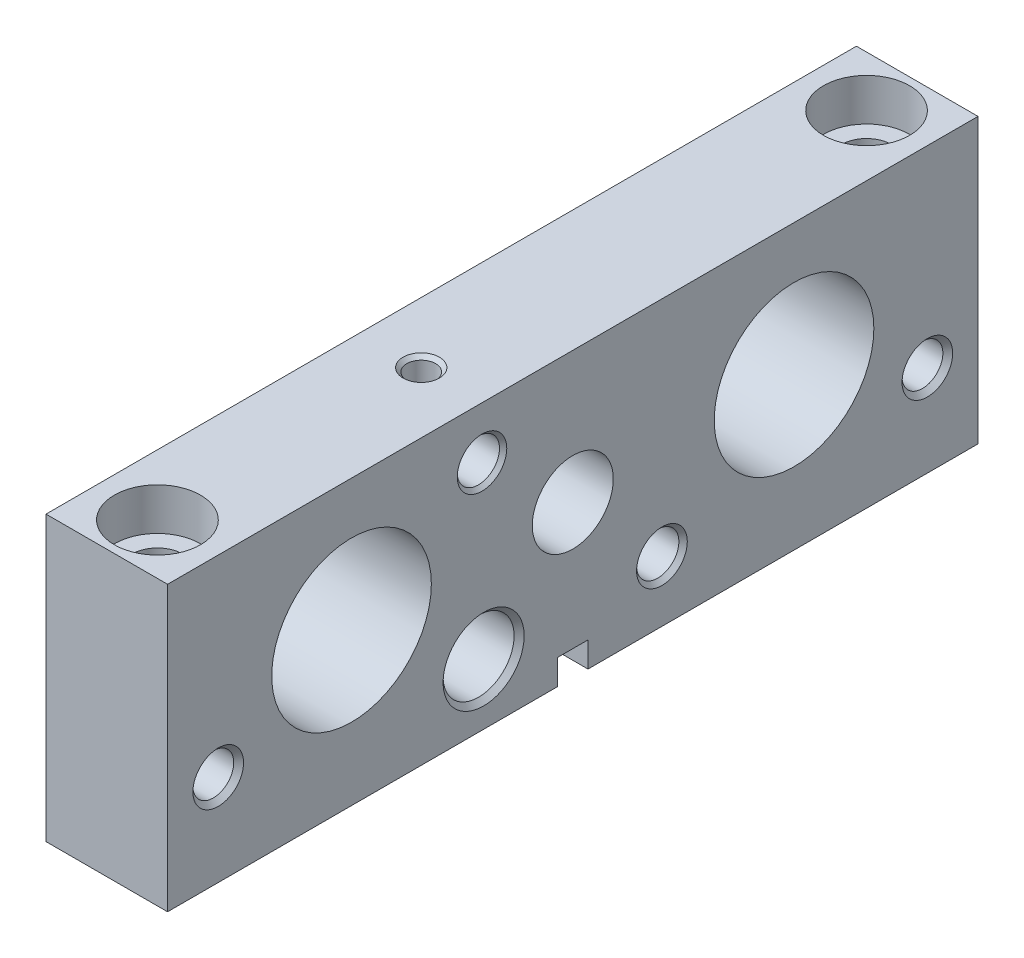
from build123d import *

# Parameters (mm, degrees)
EXTRUDE1_DEPTH     = 19.05
SKETCH2_R          = 2.38379
CUT_EXTRUDE1_DEPTH = 6.35
SKETCH9_W          = 19.05
SKETCH9_H          = 12.5095
SKETCH10_W         = 19.05
SKETCH10_H         = 12.5095


with BuildPart() as part:
    # Sketch1 → Extrude1 (new body)
    with BuildSketch(Plane(origin=(0, 0, 0), x_dir=(0, 0, -1), z_dir=(1, 0, 0))):
        Polygon((-63.5, -23.8252), (-2.38379, -23.8252), (-2.38379, -19.8628), (2.38379, -19.8628), (2.38379, -23.8252), (63.5, -23.8252), (63.5, 20.6248), (-63.5, 20.6248), align=None)
    extrude(amount=EXTRUDE1_DEPTH)

    # Sketch2 → Cut-Extrude1 (cut)
    with BuildSketch(Plane(origin=(0, -19.8628, 0), x_dir=(-1, 0, 0), z_dir=(0, 1, 0))):
        with Locations(Location((-9.525, 0, 0), (0, 0, 90))):
            Circle(SKETCH2_R)
    extrude(amount=CUT_EXTRUDE1_DEPTH, mode=Mode.SUBTRACT)

    # Sketch3 → Cut-Revolve1 (revolve, cut)
    with BuildSketch(Plane(origin=(0, -14.3002, 0), x_dir=(-1, 0, 0), z_dir=(0, 1, 0)), mode=Mode.PRIVATE) as cut_revolve1_sk:
        Polygon((-19.05, -13.97), (-19.05, -9.9949), (-18.3896, -10.6553), (-0.6604, -10.6553), (0, -9.9949), (0, -13.97), align=None)
    revolve(cut_revolve1_sk.sketch.rotate(Axis((0, -14.3002, -13.97), (1, 0, 0)), 180), axis=Axis((0, -14.3002, -13.97), (1, 0, 0)), mode=Mode.SUBTRACT)

    # Sketch4 → Cut-Revolve2 (revolve, cut)
    with BuildSketch(Plane(origin=(0, -14.3002, 0), x_dir=(-1, 0, 0), z_dir=(0, 1, 0)), mode=Mode.PRIVATE) as cut_revolve2_sk:
        Polygon((-19.05, 13.97), (-19.05, 20.32), (-18.2626, 19.5326), (-0.7874, 19.5326), (0, 20.32), (0, 13.97), align=None)
    revolve(cut_revolve2_sk.sketch.rotate(Axis((0, -14.3002, 13.97), (1, 0, 0)), 180), axis=Axis((0, -14.3002, 13.97), (1, 0, 0)), mode=Mode.SUBTRACT)

    # Sketch5 → Cut-Revolve3 (revolve, cut)
    with BuildSketch(Plane(origin=(0, 12.4968, 0), x_dir=(-1, 0, 0), z_dir=(0, 1, 0)), mode=Mode.PRIVATE) as cut_revolve3_sk:
        Polygon((-19.05, 14.224), (-19.05, 18.104), (-18.4795, 17.5335), (-0.5705, 17.5335), (0, 18.104), (0, 14.224), align=None)
    revolve(cut_revolve3_sk.sketch.rotate(Axis((0, 12.4968, 14.224), (1, 0, 0)), 180), axis=Axis((0, 12.4968, 14.224), (1, 0, 0)), mode=Mode.SUBTRACT)

    # Sketch6 → Cut-Revolve4 (revolve, cut)
    with BuildSketch(Plane.XY.offset(-55.5625), mode=Mode.PRIVATE) as cut_revolve4_sk:
        Polygon((9.525, 20.6248), (16.27251, 20.6248), (16.27251, 14.0208), (13.49375, 14.0208), (13.49375, -23.8252), (9.525, -23.8252), align=None)
    revolve(cut_revolve4_sk.sketch.rotate(Axis((9.525, -23.8252, -55.5625), (0, 1, 0)), 270), axis=Axis((9.525, -23.8252, -55.5625), (0, 1, 0)), mode=Mode.SUBTRACT)

    # Sketch7 → Cut-Revolve5 (revolve, cut)
    with BuildSketch(Plane.XY.offset(55.5625), mode=Mode.PRIVATE) as cut_revolve5_sk:
        Polygon((9.525, 20.6248), (16.27251, 20.6248), (16.27251, 14.0208), (13.49375, 14.0208), (13.49375, -23.8252), (9.525, -23.8252), align=None)
    revolve(cut_revolve5_sk.sketch.rotate(Axis((9.525, -23.8252, 55.5625), (0, 1, 0)), 270), axis=Axis((9.525, -23.8252, 55.5625), (0, 1, 0)), mode=Mode.SUBTRACT)

    # Sketch8 → Cut-Revolve6 (revolve, cut)
    with BuildSketch(Plane.XY.offset(14.224), mode=Mode.PRIVATE) as cut_revolve6_sk:
        Polygon((9.525, 20.6248), (12.3698, 20.6248), (11.7856, 20.0406), (11.7856, 16.256), (9.525, 14.950841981), align=None)
    revolve(cut_revolve6_sk.sketch.rotate(Axis((9.525, 14.950841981, 14.224), (0, 1, 0)), 270), axis=Axis((9.525, 14.950841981, 14.224), (0, 1, 0)), mode=Mode.SUBTRACT)

    # Sketch9 → Cut-Revolve7 (revolve, cut)
    with BuildSketch(Plane(origin=(0, 0, 0), x_dir=(-1, 0, 0), z_dir=(0, 1, 0)), mode=Mode.PRIVATE) as cut_revolve7_sk:
        with Locations((-9.525, 40.92575)):
            Rectangle(SKETCH9_W, SKETCH9_H)
    revolve(cut_revolve7_sk.sketch.rotate(Axis((0, 0, 34.671), (1, 0, 0)), 180), axis=Axis((0, 0, 34.671), (1, 0, 0)), mode=Mode.SUBTRACT)

    # Sketch10 → Cut-Revolve8 (revolve, cut)
    with BuildSketch(Plane(origin=(0, 0, 0), x_dir=(-1, 0, 0), z_dir=(0, 1, 0)), mode=Mode.PRIVATE) as cut_revolve8_sk:
        with Locations((-9.525, -28.41625)):
            Rectangle(SKETCH10_W, SKETCH10_H)
    revolve(cut_revolve8_sk.sketch.rotate(Axis((0, 0, -34.671), (1, 0, 0)), 180), axis=Axis((0, 0, -34.671), (1, 0, 0)), mode=Mode.SUBTRACT)

    # Sketch11 → Cut-Revolve9 (revolve, cut)
    with BuildSketch(Plane(origin=(0, 0, 0), x_dir=(-1, 0, 0), z_dir=(0, 1, 0)), mode=Mode.PRIVATE) as cut_revolve9_sk:
        Polygon((0, 0), (0, -5.131765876), (-0.600424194, -4.531341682), (-9.525, -4.252434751), (-9.525, -6.35), (-19.05, -6.35), (-19.05, 0), align=None)
    revolve(cut_revolve9_sk.sketch.rotate(Axis((19.05, 0, 0), (-1, 0, 0)), 180), axis=Axis((19.05, 0, 0), (-1, 0, 0)), mode=Mode.SUBTRACT)

    # Sketch13 → Cut-Revolve10 (revolve, cut)
    with BuildSketch(Plane(origin=(0, -9.525, 0), x_dir=(-1, 0, 0), z_dir=(0, 1, 0)), mode=Mode.PRIVATE) as cut_revolve10_sk:
        Polygon((-19.05, -55.5625), (-19.05, -51.59375), (-18.28165, -52.3621), (-0.76835, -52.3621), (0, -51.59375), (0, -55.5625), align=None)
    revolve(cut_revolve10_sk.sketch.rotate(Axis((0, -9.525, -55.5625), (1, 0, 0)), 180), axis=Axis((0, -9.525, -55.5625), (1, 0, 0)), mode=Mode.SUBTRACT)

    # Sketch12 → Cut-Revolve11 (revolve, cut)
    with BuildSketch(Plane(origin=(0, -9.525, 0), x_dir=(-1, 0, 0), z_dir=(0, 1, 0)), mode=Mode.PRIVATE) as cut_revolve11_sk:
        Polygon((-19.05, 55.5625), (-19.05, 59.53125), (-18.28165, 58.7629), (-0.76835, 58.7629), (0, 59.53125), (0, 55.5625), align=None)
    revolve(cut_revolve11_sk.sketch.rotate(Axis((0, -9.525, 55.5625), (1, 0, 0)), 180), axis=Axis((0, -9.525, 55.5625), (1, 0, 0)), mode=Mode.SUBTRACT)


solid = part.part
